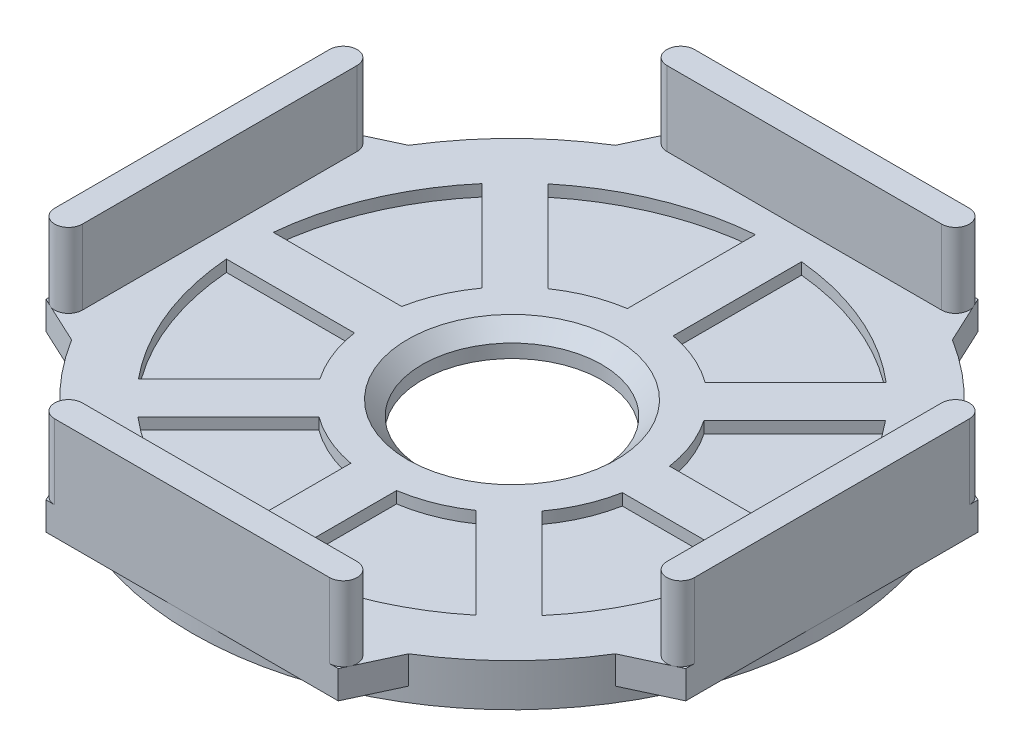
from build123d import *

# Parameters (mm, degrees)
ESQUISSE1_R             = 12.35
BOSS_EXTRU_1_DEPTH      = 3.85
BOSS_EXTRU_2_DEPTH      = 10.25
ENL_V_MAT_EXTRU_1_DEPTH = 1.6
ESQUISSE4_R             = 44
ESQUISSE4_R_2           = 19
BOSS_EXTRU_3_DEPTH      = 2
CHANFREIN1_SIZE         = 2


with BuildPart() as part:
    # Esquisse1 → Boss.-Extru.1 (new body)
    with BuildSketch(Plane(origin=(0, 0, 0), x_dir=(1, 0, 0), z_dir=(0, 1, 0))):
        with BuildLine():
            Line((37.400704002, 23.177302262), (44, 20.1))
            Line((44, 20.1), (44, -20.1))
            Line((44, -20.1), (37.400704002, -23.177302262))
            ThreePointArc((37.400704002, -23.177302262), (31.112698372, -31.112698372), (23.177302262, -37.400704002))
            Line((23.177302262, -37.400704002), (20.1, -44))
            Line((20.1, -44), (-20.1, -44))
            Line((-20.1, -44), (-23.177302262, -37.400704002))
            ThreePointArc((-23.177302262, -37.400704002), (-31.112698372, -31.112698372), (-37.400704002, -23.177302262))
            Line((-37.400704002, -23.177302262), (-44, -20.1))
            Line((-44, -20.1), (-44, 20.1))
            Line((-44, 20.1), (-37.400704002, 23.177302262))
            ThreePointArc((-37.400704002, 23.177302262), (-31.112698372, 31.112698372), (-23.177302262, 37.400704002))
            Line((-23.177302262, 37.400704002), (-20.1, 44))
            Line((-20.1, 44), (20.1, 44))
            Line((20.1, 44), (23.177302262, 37.400704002))
            ThreePointArc((23.177302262, 37.400704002), (31.112698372, 31.112698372), (37.400704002, 23.177302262))
        make_face()
        with Locations(Location((0, 0, 0), (0, 0, 90))):
            Circle(ESQUISSE1_R, mode=Mode.SUBTRACT)
    extrude(amount=BOSS_EXTRU_1_DEPTH)

    # Esquisse2 → Boss.-Extru.2 (add)
    with BuildSketch(Plane(origin=(0, 3.85, 0), x_dir=(1, 0, 0), z_dir=(0, 1, 0))):
        with BuildLine():
            Line((44, 18.9), (44, -18.9))
            ThreePointArc((44, -18.9), (42.1, -20.8), (40.2, -18.9))
            Line((40.2, -18.9), (40.2, 18.9))
            ThreePointArc((40.2, 18.9), (42.1, 20.8), (44, 18.9))
        make_face()
        with BuildLine():
            Line((18.9, -44), (-18.9, -44))
            ThreePointArc((-18.9, -44), (-20.8, -42.1), (-18.9, -40.2))
            Line((-18.9, -40.2), (18.9, -40.2))
            ThreePointArc((18.9, -40.2), (20.8, -42.1), (18.9, -44))
        make_face()
        with BuildLine():
            Line((-44, -18.9), (-44, 18.9))
            ThreePointArc((-44, 18.9), (-42.1, 20.8), (-40.2, 18.9))
            Line((-40.2, 18.9), (-40.2, -18.9))
            ThreePointArc((-40.2, -18.9), (-42.1, -20.8), (-44, -18.9))
        make_face()
        with BuildLine():
            Line((-18.9, 44), (18.9, 44))
            ThreePointArc((18.9, 44), (20.8, 42.1), (18.9, 40.2))
            Line((18.9, 40.2), (-18.9, 40.2))
            ThreePointArc((-18.9, 40.2), (-20.8, 42.1), (-18.9, 44))
        make_face()
    extrude(amount=BOSS_EXTRU_2_DEPTH)

    # Esquisse3 → Enl_v. mat.-Extru.1 (cut)
    with BuildSketch(Plane(origin=(0, 3.85, 0), x_dir=(1, 0, 0), z_dir=(0, 1, 0))):
        with BuildLine():
            Line((3.5, 36.331804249), (3.5, 18.674849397))
            ThreePointArc((3.5, 18.674849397), (7.550303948, 17.435392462), (11.225367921, 15.329419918))
            Line((11.225367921, 15.329419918), (23.675667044, 27.779719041))
            ThreePointArc((23.675667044, 27.779719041), (14.244780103, 33.605598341), (3.5, 36.331804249))
        make_face()
        with BuildLine():
            Line((28.165338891, 23.215591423), (15.67998638, 10.730238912))
            ThreePointArc((15.67998638, 10.730238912), (17.667555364, 6.989813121), (18.777070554, 2.902002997))
            Line((18.777070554, 2.902002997), (36.38445243, 2.902002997))
            ThreePointArc((36.38445243, 2.902002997), (33.83532708, 13.690165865), (28.165338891, 23.215591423))
        make_face()
        with BuildLine():
            Line((36.331804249, -3.5), (18.674849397, -3.5))
            ThreePointArc((18.674849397, -3.5), (17.435392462, -7.550303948), (15.329419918, -11.225367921))
            Line((15.329419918, -11.225367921), (27.779719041, -23.675667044))
            ThreePointArc((27.779719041, -23.675667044), (33.605598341, -14.244780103), (36.331804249, -3.5))
        make_face()
        with BuildLine():
            Line((23.215591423, -28.165338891), (10.730238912, -15.67998638))
            ThreePointArc((10.730238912, -15.67998638), (6.989813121, -17.667555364), (2.902002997, -18.777070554))
            Line((2.902002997, -18.777070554), (2.902002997, -36.38445243))
            ThreePointArc((2.902002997, -36.38445243), (13.690165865, -33.83532708), (23.215591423, -28.165338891))
        make_face()
        with BuildLine():
            Line((-3.5, -36.331804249), (-3.5, -18.674849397))
            ThreePointArc((-3.5, -18.674849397), (-7.550303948, -17.435392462), (-11.225367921, -15.329419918))
            Line((-11.225367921, -15.329419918), (-23.675667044, -27.779719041))
            ThreePointArc((-23.675667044, -27.779719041), (-14.244780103, -33.605598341), (-3.5, -36.331804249))
        make_face()
        with BuildLine():
            Line((-28.165338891, -23.215591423), (-15.67998638, -10.730238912))
            ThreePointArc((-15.67998638, -10.730238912), (-17.667555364, -6.989813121), (-18.777070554, -2.902002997))
            Line((-18.777070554, -2.902002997), (-36.38445243, -2.902002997))
            ThreePointArc((-36.38445243, -2.902002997), (-33.83532708, -13.690165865), (-28.165338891, -23.215591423))
        make_face()
        with BuildLine():
            Line((-36.331804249, 3.5), (-18.674849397, 3.5))
            ThreePointArc((-18.674849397, 3.5), (-17.435392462, 7.550303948), (-15.329419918, 11.225367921))
            Line((-15.329419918, 11.225367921), (-27.779719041, 23.675667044))
            ThreePointArc((-27.779719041, 23.675667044), (-33.605598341, 14.244780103), (-36.331804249, 3.5))
        make_face()
        with BuildLine():
            Line((-23.215591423, 28.165338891), (-10.730238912, 15.67998638))
            ThreePointArc((-10.730238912, 15.67998638), (-6.989813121, 17.667555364), (-2.902002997, 18.777070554))
            Line((-2.902002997, 18.777070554), (-2.902002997, 36.38445243))
            ThreePointArc((-2.902002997, 36.38445243), (-13.690165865, 33.83532708), (-23.215591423, 28.165338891))
        make_face()
    extrude(amount=-ENL_V_MAT_EXTRU_1_DEPTH, mode=Mode.SUBTRACT)

    # Esquisse4 → Boss.-Extru.3 (add)
    with BuildSketch(Plane.XZ):
        with Locations(Location((0, 0, 0), (0, 0, 270))):
            Circle(ESQUISSE4_R)
        with Locations(Location((0, 0, 0), (0, 0, 270))):
            Circle(ESQUISSE4_R_2, mode=Mode.SUBTRACT)
        with BuildLine():
            Line((2, 40.951190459), (2, 22.912878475))
            ThreePointArc((2, 22.912878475), (8.801718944, 21.249229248), (14.787638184, 17.616065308))
            Line((14.787638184, 17.616065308), (27.542650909, 30.371078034))
            ThreePointArc((27.542650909, 30.371078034), (15.690020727, 37.879060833), (2, 40.951190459))
        make_face(mode=Mode.SUBTRACT)
        with BuildLine():
            Line((30.371078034, 27.542650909), (17.616065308, 14.787638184))
            ThreePointArc((17.616065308, 14.787638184), (21.249229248, 8.801718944), (22.912878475, 2))
            Line((22.912878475, 2), (40.951190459, 2))
            ThreePointArc((40.951190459, 2), (37.879060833, 15.690020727), (30.371078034, 27.542650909))
        make_face(mode=Mode.SUBTRACT)
        with BuildLine():
            Line((40.951190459, -2), (22.912878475, -2))
            ThreePointArc((22.912878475, -2), (21.249229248, -8.801718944), (17.616065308, -14.787638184))
            Line((17.616065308, -14.787638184), (30.371078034, -27.542650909))
            ThreePointArc((30.371078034, -27.542650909), (37.879060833, -15.690020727), (40.951190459, -2))
        make_face(mode=Mode.SUBTRACT)
        with BuildLine():
            Line((27.542650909, -30.371078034), (14.787638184, -17.616065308))
            ThreePointArc((14.787638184, -17.616065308), (8.801718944, -21.249229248), (2, -22.912878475))
            Line((2, -22.912878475), (2, -40.951190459))
            ThreePointArc((2, -40.951190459), (15.690020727, -37.879060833), (27.542650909, -30.371078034))
        make_face(mode=Mode.SUBTRACT)
        with BuildLine():
            Line((-2, -40.951190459), (-2, -22.912878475))
            ThreePointArc((-2, -22.912878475), (-8.801718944, -21.249229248), (-14.787638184, -17.616065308))
            Line((-14.787638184, -17.616065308), (-27.542650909, -30.371078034))
            ThreePointArc((-27.542650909, -30.371078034), (-15.690020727, -37.879060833), (-2, -40.951190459))
        make_face(mode=Mode.SUBTRACT)
        with BuildLine():
            Line((-30.371078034, -27.542650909), (-17.616065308, -14.787638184))
            ThreePointArc((-17.616065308, -14.787638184), (-21.249229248, -8.801718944), (-22.912878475, -2))
            Line((-22.912878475, -2), (-40.951190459, -2))
            ThreePointArc((-40.951190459, -2), (-37.879060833, -15.690020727), (-30.371078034, -27.542650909))
        make_face(mode=Mode.SUBTRACT)
        with BuildLine():
            Line((-40.951190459, 2), (-22.912878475, 2))
            ThreePointArc((-22.912878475, 2), (-21.249229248, 8.801718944), (-17.616065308, 14.787638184))
            Line((-17.616065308, 14.787638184), (-30.371078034, 27.542650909))
            ThreePointArc((-30.371078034, 27.542650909), (-37.879060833, 15.690020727), (-40.951190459, 2))
        make_face(mode=Mode.SUBTRACT)
        with BuildLine():
            Line((-27.542650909, 30.371078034), (-14.787638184, 17.616065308))
            ThreePointArc((-14.787638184, 17.616065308), (-8.801718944, 21.249229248), (-2, 22.912878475))
            Line((-2, 22.912878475), (-2, 40.951190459))
            ThreePointArc((-2, 40.951190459), (-15.690020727, 37.879060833), (-27.542650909, 30.371078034))
        make_face(mode=Mode.SUBTRACT)
    extrude(amount=BOSS_EXTRU_3_DEPTH)

    # Chanfrein1
    chanfrein1_edges = [part.edges().sort_by_distance(p)[0] for p in [
        (0, 3.85, 12.35),
    ]]
    chamfer(chanfrein1_edges, length=CHANFREIN1_SIZE)


solid = part.part
